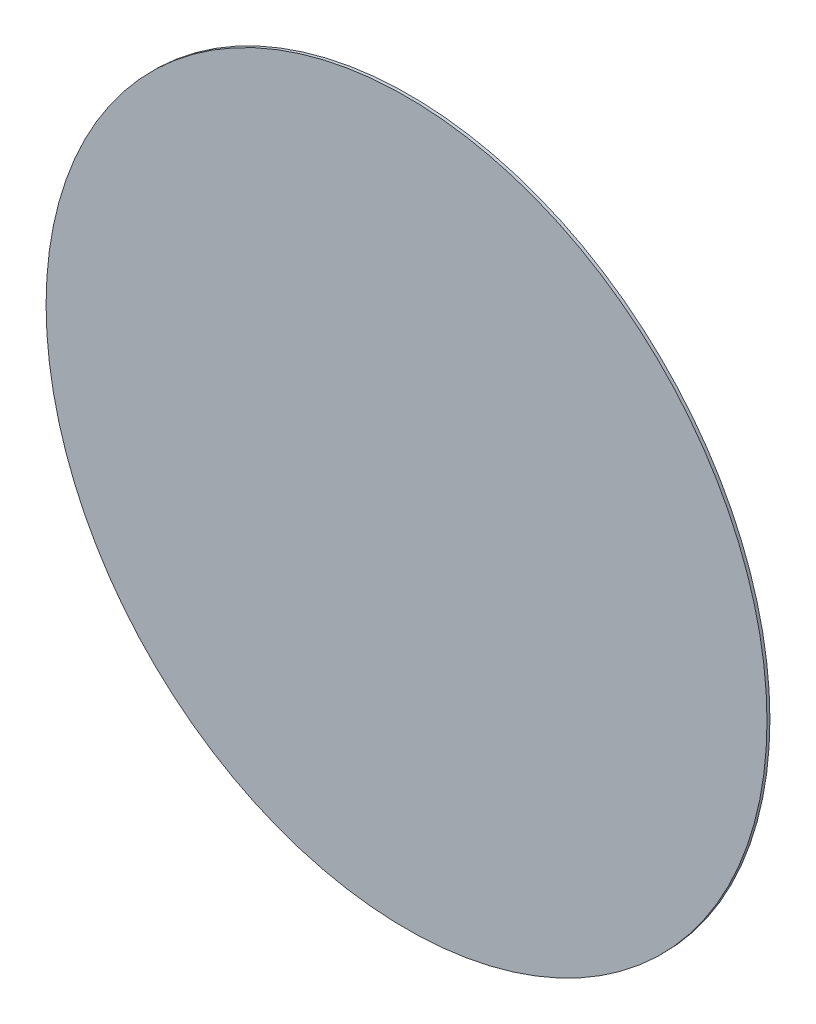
ISO-10303-21;
HEADER;
FILE_DESCRIPTION(('STEP AP214'),'2;1');
FILE_NAME('part.step','',(''),(''),'','','');
FILE_SCHEMA(('AUTOMOTIVE_DESIGN { 1 0 10303 214 1 1 1 1 }'));
ENDSEC;
DATA;
#1=APPLICATION_CONTEXT('core data for automotive mechanical design processes');
#2=APPLICATION_PROTOCOL_DEFINITION('international standard','automotive_design',2000,#1);
#3=PRODUCT_CONTEXT('',#1,'mechanical');
#4=PRODUCT('Part','Part','',(#3));
#5=PRODUCT_RELATED_PRODUCT_CATEGORY('part','',(#4));
#6=PRODUCT_DEFINITION_FORMATION('','',#4);
#7=PRODUCT_DEFINITION_CONTEXT('part definition',#1,'design');
#8=PRODUCT_DEFINITION('design','',#6,#7);
#9=PRODUCT_DEFINITION_SHAPE('','',#8);
#10=(LENGTH_UNIT() NAMED_UNIT(*) SI_UNIT(.MILLI.,.METRE.));
#11=(NAMED_UNIT(*) PLANE_ANGLE_UNIT() SI_UNIT($,.RADIAN.));
#12=(NAMED_UNIT(*) SI_UNIT($,.STERADIAN.) SOLID_ANGLE_UNIT());
#13=UNCERTAINTY_MEASURE_WITH_UNIT(LENGTH_MEASURE(1.E-05),#10,'distance_accuracy_value','');
#14=(GEOMETRIC_REPRESENTATION_CONTEXT(3) GLOBAL_UNCERTAINTY_ASSIGNED_CONTEXT((#13)) GLOBAL_UNIT_ASSIGNED_CONTEXT((#10,
#11,#12)) REPRESENTATION_CONTEXT('',''));
#15=CARTESIAN_POINT('',(0.,0.,0.));
#16=DIRECTION('',(0.,0.,1.));
#17=DIRECTION('',(1.,0.,0.));
#18=AXIS2_PLACEMENT_3D('',#15,#16,#17);
#19=CARTESIAN_POINT('',(0.,0.,0.1016));
#20=DIRECTION('',(0.,0.,-1.));
#21=DIRECTION('',(-1.,0.,0.));
#22=AXIS2_PLACEMENT_3D('',#19,#20,#21);
#23=CYLINDRICAL_SURFACE('',#22,12.5);
#24=CARTESIAN_POINT('',(0.,0.,0.1016));
#25=DIRECTION('',(0.,0.,1.));
#26=DIRECTION('',(1.,0.,0.));
#27=AXIS2_PLACEMENT_3D('',#24,#25,#26);
#28=CIRCLE('',#27,12.5);
#29=CARTESIAN_POINT('',(12.5,0.,0.1016));
#30=VERTEX_POINT('',#29);
#31=EDGE_CURVE('E10',#30,#30,#28,.T.);
#32=ORIENTED_EDGE('',*,*,#31,.F.);
#33=EDGE_LOOP('',(#32));
#34=FACE_BOUND('',#33,.T.);
#35=CARTESIAN_POINT('',(0.,0.,0.));
#36=DIRECTION('',(0.,0.,1.));
#37=DIRECTION('',(1.,0.,0.));
#38=AXIS2_PLACEMENT_3D('',#35,#36,#37);
#39=CIRCLE('',#38,12.5);
#40=CARTESIAN_POINT('',(12.5,0.,0.));
#41=VERTEX_POINT('',#40);
#42=EDGE_CURVE('E34',#41,#41,#39,.T.);
#43=ORIENTED_EDGE('',*,*,#42,.T.);
#44=EDGE_LOOP('',(#43));
#45=FACE_BOUND('',#44,.T.);
#46=ADVANCED_FACE('F28',(#34,#45),#23,.T.);
#47=CARTESIAN_POINT('',(0.,0.,0.1016));
#48=DIRECTION('',(0.,0.,1.));
#49=DIRECTION('',(1.,0.,0.));
#50=AXIS2_PLACEMENT_3D('',#47,#48,#49);
#51=PLANE('',#50);
#52=ORIENTED_EDGE('',*,*,#31,.T.);
#53=EDGE_LOOP('',(#52));
#54=FACE_BOUND('',#53,.T.);
#55=ADVANCED_FACE('F43',(#54),#51,.T.);
#56=CARTESIAN_POINT('',(0.,0.,0.));
#57=DIRECTION('',(0.,0.,1.));
#58=DIRECTION('',(1.,0.,0.));
#59=AXIS2_PLACEMENT_3D('',#56,#57,#58);
#60=PLANE('',#59);
#61=ORIENTED_EDGE('',*,*,#42,.F.);
#62=EDGE_LOOP('',(#61));
#63=FACE_BOUND('',#62,.T.);
#64=ADVANCED_FACE('F41',(#63),#60,.F.);
#65=CLOSED_SHELL('',(#46,#55,#64));
#66=MANIFOLD_SOLID_BREP('B2',#65);
#67=ADVANCED_BREP_SHAPE_REPRESENTATION('',(#18,#66),#14);
#68=SHAPE_DEFINITION_REPRESENTATION(#9,#67);
ENDSEC;
END-ISO-10303-21;
